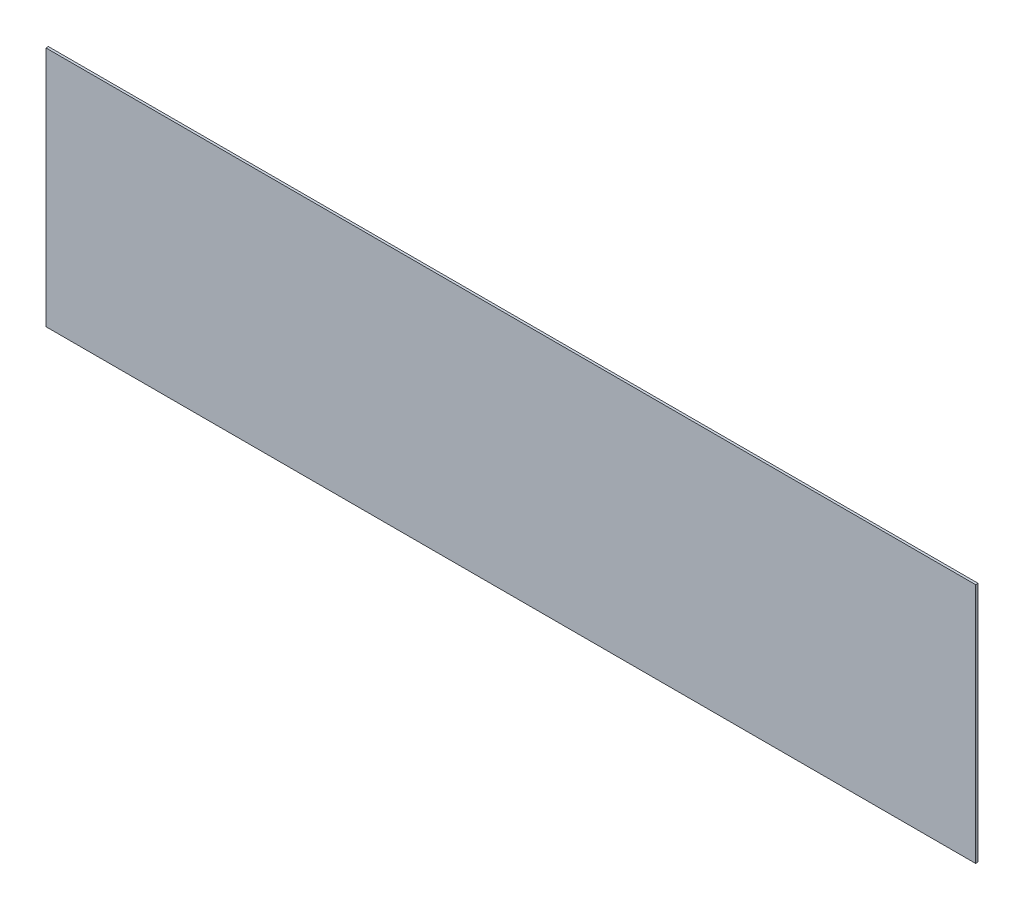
from build123d import *

# Parameters (mm, degrees)
SCHIZZO1_W                   = 770
SCHIZZO1_H                   = 200
ESTRUSIONE_ESTRUSIONE1_DEPTH = 2


with BuildPart() as part:
    # Schizzo1 → Estrusione-Estrusione1 (new body)
    with BuildSketch(Plane.XY):
        Rectangle(SCHIZZO1_W, SCHIZZO1_H)
    extrude(amount=ESTRUSIONE_ESTRUSIONE1_DEPTH)


solid = part.part
